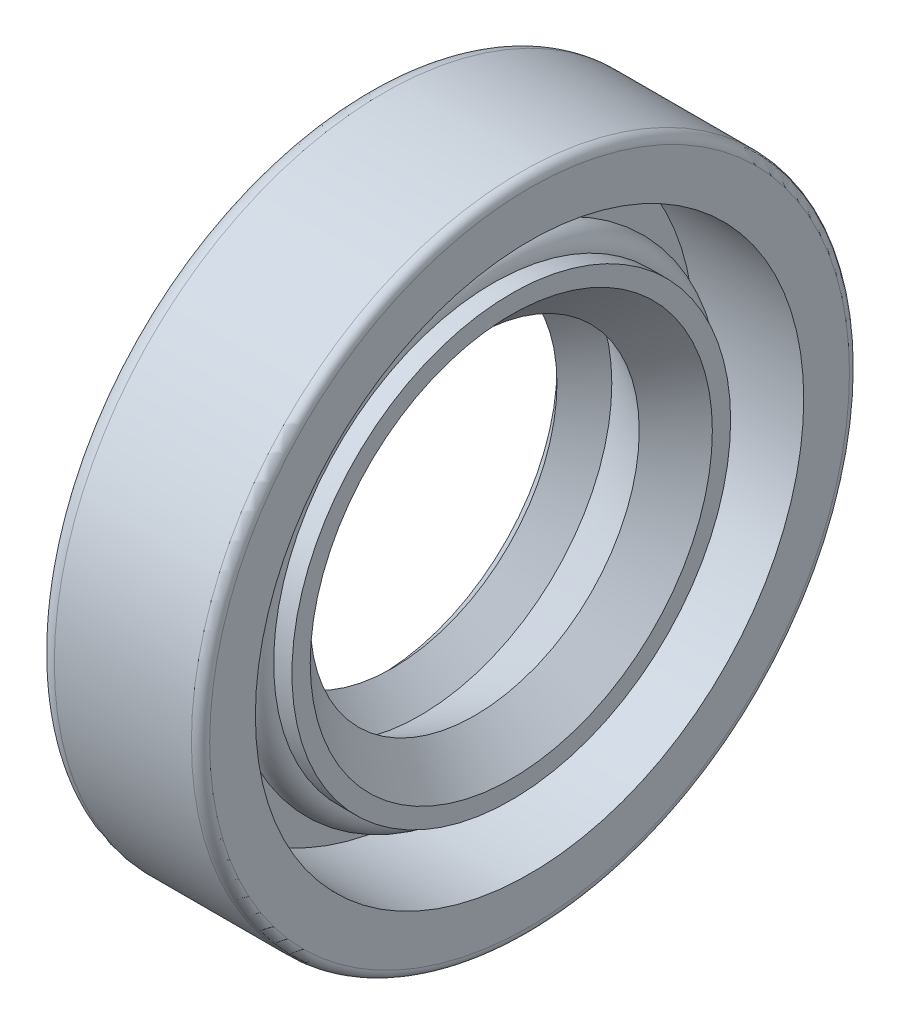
ISO-10303-21;
HEADER;
FILE_DESCRIPTION(('STEP AP214'),'2;1');
FILE_NAME('part.step','',(''),(''),'','','');
FILE_SCHEMA(('AUTOMOTIVE_DESIGN { 1 0 10303 214 1 1 1 1 }'));
ENDSEC;
DATA;
#1=APPLICATION_CONTEXT('core data for automotive mechanical design processes');
#2=APPLICATION_PROTOCOL_DEFINITION('international standard','automotive_design',2000,#1);
#3=PRODUCT_CONTEXT('',#1,'mechanical');
#4=PRODUCT('Part','Part','',(#3));
#5=PRODUCT_RELATED_PRODUCT_CATEGORY('part','',(#4));
#6=PRODUCT_DEFINITION_FORMATION('','',#4);
#7=PRODUCT_DEFINITION_CONTEXT('part definition',#1,'design');
#8=PRODUCT_DEFINITION('design','',#6,#7);
#9=PRODUCT_DEFINITION_SHAPE('','',#8);
#10=(LENGTH_UNIT() NAMED_UNIT(*) SI_UNIT(.MILLI.,.METRE.));
#11=(NAMED_UNIT(*) PLANE_ANGLE_UNIT() SI_UNIT($,.RADIAN.));
#12=(NAMED_UNIT(*) SI_UNIT($,.STERADIAN.) SOLID_ANGLE_UNIT());
#13=UNCERTAINTY_MEASURE_WITH_UNIT(LENGTH_MEASURE(1.E-05),#10,'distance_accuracy_value','');
#14=(GEOMETRIC_REPRESENTATION_CONTEXT(3) GLOBAL_UNCERTAINTY_ASSIGNED_CONTEXT((#13)) GLOBAL_UNIT_ASSIGNED_CONTEXT((#10,
#11,#12)) REPRESENTATION_CONTEXT('',''));
#15=CARTESIAN_POINT('',(0.,0.,0.));
#16=DIRECTION('',(0.,0.,1.));
#17=DIRECTION('',(1.,0.,0.));
#18=AXIS2_PLACEMENT_3D('',#15,#16,#17);
#19=CARTESIAN_POINT('',(1.11111111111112,0.,0.));
#20=DIRECTION('',(1.,0.,0.));
#21=DIRECTION('',(0.,0.,-1.));
#22=AXIS2_PLACEMENT_3D('',#19,#20,#21);
#23=TOROIDAL_SURFACE('',#22,18.8888888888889,1.11111111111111);
#24=CARTESIAN_POINT('',(0.,0.,0.));
#25=DIRECTION('',(1.,0.,0.));
#26=DIRECTION('',(0.,0.,-1.));
#27=AXIS2_PLACEMENT_3D('',#24,#25,#26);
#28=CIRCLE('',#27,18.8888888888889);
#29=CARTESIAN_POINT('',(0.,0.,-18.8888888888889));
#30=VERTEX_POINT('',#29);
#31=EDGE_CURVE('E10',#30,#30,#28,.T.);
#32=ORIENTED_EDGE('',*,*,#31,.T.);
#33=EDGE_LOOP('',(#32));
#34=FACE_BOUND('',#33,.T.);
#35=CARTESIAN_POINT('',(1.11111111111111,0.,0.));
#36=DIRECTION('',(1.,0.,0.));
#37=DIRECTION('',(0.,0.,-1.));
#38=AXIS2_PLACEMENT_3D('',#35,#36,#37);
#39=CIRCLE('',#38,20.);
#40=CARTESIAN_POINT('',(1.11111111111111,0.,-20.));
#41=VERTEX_POINT('',#40);
#42=EDGE_CURVE('E134',#41,#41,#39,.T.);
#43=ORIENTED_EDGE('',*,*,#42,.F.);
#44=EDGE_LOOP('',(#43));
#45=FACE_BOUND('',#44,.T.);
#46=ADVANCED_FACE('F43',(#34,#45),#23,.T.);
#47=CARTESIAN_POINT('',(0.,18.8888888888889,0.));
#48=DIRECTION('',(-1.,0.,0.));
#49=DIRECTION('',(0.,0.,1.));
#50=AXIS2_PLACEMENT_3D('',#47,#48,#49);
#51=PLANE('',#50);
#52=CARTESIAN_POINT('',(0.,0.,0.));
#53=DIRECTION('',(1.,0.,0.));
#54=DIRECTION('',(0.,0.,-1.));
#55=AXIS2_PLACEMENT_3D('',#52,#53,#54);
#56=CIRCLE('',#55,16.6666666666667);
#57=CARTESIAN_POINT('',(0.,0.,-16.6666666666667));
#58=VERTEX_POINT('',#57);
#59=EDGE_CURVE('E50',#58,#58,#56,.T.);
#60=ORIENTED_EDGE('',*,*,#59,.T.);
#61=EDGE_LOOP('',(#60));
#62=FACE_BOUND('',#61,.T.);
#63=ORIENTED_EDGE('',*,*,#31,.F.);
#64=EDGE_LOOP('',(#63));
#65=FACE_BOUND('',#64,.T.);
#66=ADVANCED_FACE('F143',(#62,#65),#51,.T.);
#67=CARTESIAN_POINT('',(0.,0.,0.));
#68=DIRECTION('',(1.,0.,0.));
#69=DIRECTION('',(0.,0.,-1.));
#70=AXIS2_PLACEMENT_3D('',#67,#68,#69);
#71=CYLINDRICAL_SURFACE('',#70,16.6666666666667);
#72=CARTESIAN_POINT('',(0.200000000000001,0.,0.));
#73=DIRECTION('',(1.,0.,0.));
#74=DIRECTION('',(0.,0.,-1.));
#75=AXIS2_PLACEMENT_3D('',#72,#73,#74);
#76=CIRCLE('',#75,16.6666666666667);
#77=CARTESIAN_POINT('',(0.200000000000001,0.,-16.6666666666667));
#78=VERTEX_POINT('',#77);
#79=EDGE_CURVE('E55',#78,#78,#76,.T.);
#80=ORIENTED_EDGE('',*,*,#79,.T.);
#81=EDGE_LOOP('',(#80));
#82=FACE_BOUND('',#81,.T.);
#83=ORIENTED_EDGE('',*,*,#59,.F.);
#84=EDGE_LOOP('',(#83));
#85=FACE_BOUND('',#84,.T.);
#86=ADVANCED_FACE('F147',(#82,#85),#71,.F.);
#87=CARTESIAN_POINT('',(0.2,16.6666666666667,0.));
#88=DIRECTION('',(-1.,0.,0.));
#89=DIRECTION('',(0.,0.,1.));
#90=AXIS2_PLACEMENT_3D('',#87,#88,#89);
#91=PLANE('',#90);
#92=CARTESIAN_POINT('',(0.2,0.,0.));
#93=DIRECTION('',(1.,0.,0.));
#94=DIRECTION('',(0.,0.,-1.));
#95=AXIS2_PLACEMENT_3D('',#92,#93,#94);
#96=CIRCLE('',#95,13.3333333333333);
#97=CARTESIAN_POINT('',(0.2,0.,-13.3333333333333));
#98=VERTEX_POINT('',#97);
#99=EDGE_CURVE('E60',#98,#98,#96,.T.);
#100=ORIENTED_EDGE('',*,*,#99,.T.);
#101=EDGE_LOOP('',(#100));
#102=FACE_BOUND('',#101,.T.);
#103=ORIENTED_EDGE('',*,*,#79,.F.);
#104=EDGE_LOOP('',(#103));
#105=FACE_BOUND('',#104,.T.);
#106=ADVANCED_FACE('F151',(#102,#105),#91,.T.);
#107=CARTESIAN_POINT('',(0.,0.,0.));
#108=DIRECTION('',(1.,0.,0.));
#109=DIRECTION('',(0.,0.,-1.));
#110=AXIS2_PLACEMENT_3D('',#107,#108,#109);
#111=CYLINDRICAL_SURFACE('',#110,13.3333333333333);
#112=CARTESIAN_POINT('',(0.,0.,0.));
#113=DIRECTION('',(1.,0.,0.));
#114=DIRECTION('',(0.,0.,-1.));
#115=AXIS2_PLACEMENT_3D('',#112,#113,#114);
#116=CIRCLE('',#115,13.3333333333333);
#117=CARTESIAN_POINT('',(0.,0.,-13.3333333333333));
#118=VERTEX_POINT('',#117);
#119=EDGE_CURVE('E66',#118,#118,#116,.T.);
#120=ORIENTED_EDGE('',*,*,#119,.T.);
#121=EDGE_LOOP('',(#120));
#122=FACE_BOUND('',#121,.T.);
#123=ORIENTED_EDGE('',*,*,#99,.F.);
#124=EDGE_LOOP('',(#123));
#125=FACE_BOUND('',#124,.T.);
#126=ADVANCED_FACE('F158',(#122,#125),#111,.T.);
#127=CARTESIAN_POINT('',(0.,13.3333333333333,0.));
#128=DIRECTION('',(-1.,0.,0.));
#129=DIRECTION('',(0.,0.,1.));
#130=AXIS2_PLACEMENT_3D('',#127,#128,#129);
#131=PLANE('',#130);
#132=CARTESIAN_POINT('',(0.,0.,0.));
#133=DIRECTION('',(1.,0.,0.));
#134=DIRECTION('',(0.,0.,-1.));
#135=AXIS2_PLACEMENT_3D('',#132,#133,#134);
#136=CIRCLE('',#135,12.5);
#137=CARTESIAN_POINT('',(0.,0.,-12.5));
#138=VERTEX_POINT('',#137);
#139=EDGE_CURVE('E70',#138,#138,#136,.T.);
#140=ORIENTED_EDGE('',*,*,#139,.T.);
#141=EDGE_LOOP('',(#140));
#142=FACE_BOUND('',#141,.T.);
#143=ORIENTED_EDGE('',*,*,#119,.F.);
#144=EDGE_LOOP('',(#143));
#145=FACE_BOUND('',#144,.T.);
#146=ADVANCED_FACE('F162',(#142,#145),#131,.T.);
#147=CARTESIAN_POINT('',(0.,0.,0.));
#148=DIRECTION('',(-1.,0.,0.));
#149=DIRECTION('',(0.,0.,1.));
#150=AXIS2_PLACEMENT_3D('',#147,#148,#149);
#151=CONICAL_SURFACE('',#150,12.5,0.463647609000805);
#152=CARTESIAN_POINT('',(1.66666666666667,0.,0.));
#153=DIRECTION('',(1.,0.,0.));
#154=DIRECTION('',(0.,0.,-1.));
#155=AXIS2_PLACEMENT_3D('',#152,#153,#154);
#156=CIRCLE('',#155,11.6666666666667);
#157=CARTESIAN_POINT('',(1.66666666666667,0.,-11.6666666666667));
#158=VERTEX_POINT('',#157);
#159=EDGE_CURVE('E74',#158,#158,#156,.T.);
#160=ORIENTED_EDGE('',*,*,#159,.T.);
#161=EDGE_LOOP('',(#160));
#162=FACE_BOUND('',#161,.T.);
#163=ORIENTED_EDGE('',*,*,#139,.F.);
#164=EDGE_LOOP('',(#163));
#165=FACE_BOUND('',#164,.T.);
#166=ADVANCED_FACE('F166',(#162,#165),#151,.F.);
#167=CARTESIAN_POINT('',(1.66666666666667,0.,0.));
#168=DIRECTION('',(1.,0.,0.));
#169=DIRECTION('',(0.,0.,-1.));
#170=AXIS2_PLACEMENT_3D('',#167,#168,#169);
#171=CONICAL_SURFACE('',#170,11.6666666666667,0.785398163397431);
#172=CARTESIAN_POINT('',(0.833333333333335,0.,0.));
#173=DIRECTION('',(1.,0.,0.));
#174=DIRECTION('',(0.,0.,-1.));
#175=AXIS2_PLACEMENT_3D('',#172,#173,#174);
#176=CIRCLE('',#175,10.8333333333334);
#177=CARTESIAN_POINT('',(0.833333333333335,0.,-10.8333333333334));
#178=VERTEX_POINT('',#177);
#179=EDGE_CURVE('E78',#178,#178,#176,.T.);
#180=ORIENTED_EDGE('',*,*,#179,.T.);
#181=EDGE_LOOP('',(#180));
#182=FACE_BOUND('',#181,.T.);
#183=ORIENTED_EDGE('',*,*,#159,.F.);
#184=EDGE_LOOP('',(#183));
#185=FACE_BOUND('',#184,.T.);
#186=ADVANCED_FACE('F170',(#182,#185),#171,.T.);
#187=CARTESIAN_POINT('',(0.833333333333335,0.,0.));
#188=DIRECTION('',(-1.,0.,0.));
#189=DIRECTION('',(0.,0.,1.));
#190=AXIS2_PLACEMENT_3D('',#187,#188,#189);
#191=CONICAL_SURFACE('',#190,10.8333333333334,0.785398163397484);
#192=CARTESIAN_POINT('',(1.66666666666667,0.,0.));
#193=DIRECTION('',(1.,0.,0.));
#194=DIRECTION('',(0.,0.,-1.));
#195=AXIS2_PLACEMENT_3D('',#192,#193,#194);
#196=CIRCLE('',#195,9.99999999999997);
#197=CARTESIAN_POINT('',(1.66666666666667,0.,-9.99999999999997));
#198=VERTEX_POINT('',#197);
#199=EDGE_CURVE('E82',#198,#198,#196,.T.);
#200=ORIENTED_EDGE('',*,*,#199,.T.);
#201=EDGE_LOOP('',(#200));
#202=FACE_BOUND('',#201,.T.);
#203=ORIENTED_EDGE('',*,*,#179,.F.);
#204=EDGE_LOOP('',(#203));
#205=FACE_BOUND('',#204,.T.);
#206=ADVANCED_FACE('F174',(#202,#205),#191,.F.);
#207=CARTESIAN_POINT('',(1.66666666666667,0.,0.));
#208=DIRECTION('',(1.,0.,0.));
#209=DIRECTION('',(0.,0.,-1.));
#210=AXIS2_PLACEMENT_3D('',#207,#208,#209);
#211=CONICAL_SURFACE('',#210,9.99999999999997,0.785398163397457);
#212=CARTESIAN_POINT('',(3.33333333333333,0.,0.));
#213=DIRECTION('',(1.,0.,0.));
#214=DIRECTION('',(0.,0.,-1.));
#215=AXIS2_PLACEMENT_3D('',#212,#213,#214);
#216=CIRCLE('',#215,11.6666666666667);
#217=CARTESIAN_POINT('',(3.33333333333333,0.,-11.6666666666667));
#218=VERTEX_POINT('',#217);
#219=EDGE_CURVE('E86',#218,#218,#216,.T.);
#220=ORIENTED_EDGE('',*,*,#219,.T.);
#221=EDGE_LOOP('',(#220));
#222=FACE_BOUND('',#221,.T.);
#223=ORIENTED_EDGE('',*,*,#199,.F.);
#224=EDGE_LOOP('',(#223));
#225=FACE_BOUND('',#224,.T.);
#226=ADVANCED_FACE('F178',(#222,#225),#211,.F.);
#227=CARTESIAN_POINT('',(3.33333333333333,0.,0.));
#228=DIRECTION('',(-1.,0.,0.));
#229=DIRECTION('',(0.,0.,1.));
#230=AXIS2_PLACEMENT_3D('',#227,#228,#229);
#231=CONICAL_SURFACE('',#230,11.6666666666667,0.463647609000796);
#232=CARTESIAN_POINT('',(6.66666666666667,0.,0.));
#233=DIRECTION('',(1.,0.,0.));
#234=DIRECTION('',(0.,0.,-1.));
#235=AXIS2_PLACEMENT_3D('',#232,#233,#234);
#236=CIRCLE('',#235,10.);
#237=CARTESIAN_POINT('',(6.66666666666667,0.,-10.));
#238=VERTEX_POINT('',#237);
#239=EDGE_CURVE('E90',#238,#238,#236,.T.);
#240=ORIENTED_EDGE('',*,*,#239,.T.);
#241=EDGE_LOOP('',(#240));
#242=FACE_BOUND('',#241,.T.);
#243=ORIENTED_EDGE('',*,*,#219,.F.);
#244=EDGE_LOOP('',(#243));
#245=FACE_BOUND('',#244,.T.);
#246=ADVANCED_FACE('F182',(#242,#245),#231,.F.);
#247=CARTESIAN_POINT('',(6.66666666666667,0.,0.));
#248=DIRECTION('',(1.,0.,0.));
#249=DIRECTION('',(0.,0.,-1.));
#250=AXIS2_PLACEMENT_3D('',#247,#248,#249);
#251=CONICAL_SURFACE('',#250,10.,0.785398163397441);
#252=CARTESIAN_POINT('',(8.88888883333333,0.,0.));
#253=DIRECTION('',(1.,0.,0.));
#254=DIRECTION('',(0.,0.,-1.));
#255=AXIS2_PLACEMENT_3D('',#252,#253,#254);
#256=CIRCLE('',#255,12.2222221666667);
#257=CARTESIAN_POINT('',(8.88888883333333,0.,-12.2222221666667));
#258=VERTEX_POINT('',#257);
#259=EDGE_CURVE('E94',#258,#258,#256,.T.);
#260=ORIENTED_EDGE('',*,*,#259,.T.);
#261=EDGE_LOOP('',(#260));
#262=FACE_BOUND('',#261,.T.);
#263=ORIENTED_EDGE('',*,*,#239,.F.);
#264=EDGE_LOOP('',(#263));
#265=FACE_BOUND('',#264,.T.);
#266=ADVANCED_FACE('F186',(#262,#265),#251,.F.);
#267=CARTESIAN_POINT('',(8.88888883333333,12.2222221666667,0.));
#268=DIRECTION('',(1.,0.,0.));
#269=DIRECTION('',(0.,0.,-1.));
#270=AXIS2_PLACEMENT_3D('',#267,#268,#269);
#271=PLANE('',#270);
#272=CARTESIAN_POINT('',(8.88888883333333,0.,0.));
#273=DIRECTION('',(1.,0.,0.));
#274=DIRECTION('',(0.,0.,-1.));
#275=AXIS2_PLACEMENT_3D('',#272,#273,#274);
#276=CIRCLE('',#275,13.3333333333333);
#277=CARTESIAN_POINT('',(8.88888883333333,0.,-13.3333333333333));
#278=VERTEX_POINT('',#277);
#279=EDGE_CURVE('E98',#278,#278,#276,.T.);
#280=ORIENTED_EDGE('',*,*,#279,.T.);
#281=EDGE_LOOP('',(#280));
#282=FACE_BOUND('',#281,.T.);
#283=ORIENTED_EDGE('',*,*,#259,.F.);
#284=EDGE_LOOP('',(#283));
#285=FACE_BOUND('',#284,.T.);
#286=ADVANCED_FACE('F190',(#282,#285),#271,.T.);
#287=CARTESIAN_POINT('',(0.,0.,0.));
#288=DIRECTION('',(1.,0.,0.));
#289=DIRECTION('',(0.,0.,-1.));
#290=AXIS2_PLACEMENT_3D('',#287,#288,#289);
#291=CYLINDRICAL_SURFACE('',#290,13.3333333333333);
#292=CARTESIAN_POINT('',(7.77777766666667,0.,0.));
#293=DIRECTION('',(1.,0.,0.));
#294=DIRECTION('',(0.,0.,-1.));
#295=AXIS2_PLACEMENT_3D('',#292,#293,#294);
#296=CIRCLE('',#295,13.3333333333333);
#297=CARTESIAN_POINT('',(7.77777766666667,0.,-13.3333333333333));
#298=VERTEX_POINT('',#297);
#299=EDGE_CURVE('E102',#298,#298,#296,.T.);
#300=ORIENTED_EDGE('',*,*,#299,.T.);
#301=EDGE_LOOP('',(#300));
#302=FACE_BOUND('',#301,.T.);
#303=ORIENTED_EDGE('',*,*,#279,.F.);
#304=EDGE_LOOP('',(#303));
#305=FACE_BOUND('',#304,.T.);
#306=ADVANCED_FACE('F194',(#302,#305),#291,.T.);
#307=CARTESIAN_POINT('',(6.66666666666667,0.,0.));
#308=DIRECTION('',(1.,0.,0.));
#309=DIRECTION('',(0.,0.,-1.));
#310=AXIS2_PLACEMENT_3D('',#307,#308,#309);
#311=TOROIDAL_SURFACE('',#310,13.3333333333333,1.111111);
#312=CARTESIAN_POINT('',(5.55555566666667,0.,0.));
#313=DIRECTION('',(1.,0.,0.));
#314=DIRECTION('',(0.,0.,-1.));
#315=AXIS2_PLACEMENT_3D('',#312,#313,#314);
#316=CIRCLE('',#315,13.3333333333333);
#317=CARTESIAN_POINT('',(5.55555566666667,0.,-13.3333333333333));
#318=VERTEX_POINT('',#317);
#319=EDGE_CURVE('E106',#318,#318,#316,.T.);
#320=ORIENTED_EDGE('',*,*,#319,.T.);
#321=EDGE_LOOP('',(#320));
#322=FACE_BOUND('',#321,.T.);
#323=ORIENTED_EDGE('',*,*,#299,.F.);
#324=EDGE_LOOP('',(#323));
#325=FACE_BOUND('',#324,.T.);
#326=ADVANCED_FACE('F198',(#322,#325),#311,.T.);
#327=CARTESIAN_POINT('',(0.,0.,0.));
#328=DIRECTION('',(1.,0.,0.));
#329=DIRECTION('',(0.,0.,-1.));
#330=AXIS2_PLACEMENT_3D('',#327,#328,#329);
#331=CYLINDRICAL_SURFACE('',#330,13.3333333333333);
#332=CARTESIAN_POINT('',(3.88888883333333,0.,0.));
#333=DIRECTION('',(1.,0.,0.));
#334=DIRECTION('',(0.,0.,-1.));
#335=AXIS2_PLACEMENT_3D('',#332,#333,#334);
#336=CIRCLE('',#335,13.3333333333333);
#337=CARTESIAN_POINT('',(3.88888883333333,0.,-13.3333333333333));
#338=VERTEX_POINT('',#337);
#339=EDGE_CURVE('E110',#338,#338,#336,.T.);
#340=ORIENTED_EDGE('',*,*,#339,.T.);
#341=EDGE_LOOP('',(#340));
#342=FACE_BOUND('',#341,.T.);
#343=ORIENTED_EDGE('',*,*,#319,.F.);
#344=EDGE_LOOP('',(#343));
#345=FACE_BOUND('',#344,.T.);
#346=ADVANCED_FACE('F202',(#342,#345),#331,.T.);
#347=CARTESIAN_POINT('',(3.88888883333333,0.,0.));
#348=DIRECTION('',(1.,0.,0.));
#349=DIRECTION('',(0.,0.,-1.));
#350=AXIS2_PLACEMENT_3D('',#347,#348,#349);
#351=TOROIDAL_SURFACE('',#350,13.8888888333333,0.555555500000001);
#352=CARTESIAN_POINT('',(3.33333333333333,0.,0.));
#353=DIRECTION('',(1.,0.,0.));
#354=DIRECTION('',(0.,0.,-1.));
#355=AXIS2_PLACEMENT_3D('',#352,#353,#354);
#356=CIRCLE('',#355,13.8888888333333);
#357=CARTESIAN_POINT('',(3.33333333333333,0.,-13.8888888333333));
#358=VERTEX_POINT('',#357);
#359=EDGE_CURVE('E114',#358,#358,#356,.T.);
#360=ORIENTED_EDGE('',*,*,#359,.T.);
#361=EDGE_LOOP('',(#360));
#362=FACE_BOUND('',#361,.T.);
#363=ORIENTED_EDGE('',*,*,#339,.F.);
#364=EDGE_LOOP('',(#363));
#365=FACE_BOUND('',#364,.T.);
#366=ADVANCED_FACE('F206',(#362,#365),#351,.F.);
#367=CARTESIAN_POINT('',(3.33333333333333,13.8888888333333,0.));
#368=DIRECTION('',(1.,0.,0.));
#369=DIRECTION('',(0.,0.,-1.));
#370=AXIS2_PLACEMENT_3D('',#367,#368,#369);
#371=PLANE('',#370);
#372=CARTESIAN_POINT('',(3.33333333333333,0.,0.));
#373=DIRECTION('',(1.,0.,0.));
#374=DIRECTION('',(0.,0.,-1.));
#375=AXIS2_PLACEMENT_3D('',#372,#373,#374);
#376=CIRCLE('',#375,16.6666666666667);
#377=CARTESIAN_POINT('',(3.33333333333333,0.,-16.6666666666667));
#378=VERTEX_POINT('',#377);
#379=EDGE_CURVE('E118',#378,#378,#376,.T.);
#380=ORIENTED_EDGE('',*,*,#379,.T.);
#381=EDGE_LOOP('',(#380));
#382=FACE_BOUND('',#381,.T.);
#383=ORIENTED_EDGE('',*,*,#359,.F.);
#384=EDGE_LOOP('',(#383));
#385=FACE_BOUND('',#384,.T.);
#386=ADVANCED_FACE('F210',(#382,#385),#371,.T.);
#387=CARTESIAN_POINT('',(0.,0.,0.));
#388=DIRECTION('',(1.,0.,0.));
#389=DIRECTION('',(0.,0.,-1.));
#390=AXIS2_PLACEMENT_3D('',#387,#388,#389);
#391=CYLINDRICAL_SURFACE('',#390,16.6666666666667);
#392=CARTESIAN_POINT('',(10.,0.,0.));
#393=DIRECTION('',(1.,0.,0.));
#394=DIRECTION('',(0.,0.,-1.));
#395=AXIS2_PLACEMENT_3D('',#392,#393,#394);
#396=CIRCLE('',#395,16.6666666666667);
#397=CARTESIAN_POINT('',(10.,0.,-16.6666666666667));
#398=VERTEX_POINT('',#397);
#399=EDGE_CURVE('E122',#398,#398,#396,.T.);
#400=ORIENTED_EDGE('',*,*,#399,.T.);
#401=EDGE_LOOP('',(#400));
#402=FACE_BOUND('',#401,.T.);
#403=ORIENTED_EDGE('',*,*,#379,.F.);
#404=EDGE_LOOP('',(#403));
#405=FACE_BOUND('',#404,.T.);
#406=ADVANCED_FACE('F214',(#402,#405),#391,.F.);
#407=CARTESIAN_POINT('',(10.,16.6666666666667,0.));
#408=DIRECTION('',(1.,0.,0.));
#409=DIRECTION('',(0.,0.,-1.));
#410=AXIS2_PLACEMENT_3D('',#407,#408,#409);
#411=PLANE('',#410);
#412=CARTESIAN_POINT('',(10.,0.,0.));
#413=DIRECTION('',(1.,0.,0.));
#414=DIRECTION('',(0.,0.,-1.));
#415=AXIS2_PLACEMENT_3D('',#412,#413,#414);
#416=CIRCLE('',#415,19.4444444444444);
#417=CARTESIAN_POINT('',(10.,0.,-19.4444444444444));
#418=VERTEX_POINT('',#417);
#419=EDGE_CURVE('E126',#418,#418,#416,.T.);
#420=ORIENTED_EDGE('',*,*,#419,.T.);
#421=EDGE_LOOP('',(#420));
#422=FACE_BOUND('',#421,.T.);
#423=ORIENTED_EDGE('',*,*,#399,.F.);
#424=EDGE_LOOP('',(#423));
#425=FACE_BOUND('',#424,.T.);
#426=ADVANCED_FACE('F218',(#422,#425),#411,.T.);
#427=CARTESIAN_POINT('',(9.44444444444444,0.,0.));
#428=DIRECTION('',(1.,0.,0.));
#429=DIRECTION('',(0.,0.,-1.));
#430=AXIS2_PLACEMENT_3D('',#427,#428,#429);
#431=TOROIDAL_SURFACE('',#430,19.4444444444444,0.555555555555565);
#432=CARTESIAN_POINT('',(9.44444444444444,0.,0.));
#433=DIRECTION('',(1.,0.,0.));
#434=DIRECTION('',(0.,0.,-1.));
#435=AXIS2_PLACEMENT_3D('',#432,#433,#434);
#436=CIRCLE('',#435,20.);
#437=CARTESIAN_POINT('',(9.44444444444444,0.,-20.));
#438=VERTEX_POINT('',#437);
#439=EDGE_CURVE('E130',#438,#438,#436,.T.);
#440=ORIENTED_EDGE('',*,*,#439,.T.);
#441=EDGE_LOOP('',(#440));
#442=FACE_BOUND('',#441,.T.);
#443=ORIENTED_EDGE('',*,*,#419,.F.);
#444=EDGE_LOOP('',(#443));
#445=FACE_BOUND('',#444,.T.);
#446=ADVANCED_FACE('F222',(#442,#445),#431,.T.);
#447=CARTESIAN_POINT('',(0.,0.,0.));
#448=DIRECTION('',(1.,0.,0.));
#449=DIRECTION('',(0.,0.,-1.));
#450=AXIS2_PLACEMENT_3D('',#447,#448,#449);
#451=CYLINDRICAL_SURFACE('',#450,20.);
#452=ORIENTED_EDGE('',*,*,#42,.T.);
#453=EDGE_LOOP('',(#452));
#454=FACE_BOUND('',#453,.T.);
#455=ORIENTED_EDGE('',*,*,#439,.F.);
#456=EDGE_LOOP('',(#455));
#457=FACE_BOUND('',#456,.T.);
#458=ADVANCED_FACE('F139',(#454,#457),#451,.T.);
#459=CLOSED_SHELL('',(#46,#66,#86,#106,#126,#146,#166,#186,#206,#226,#246,#266,#286,#306,#326,
#346,#366,#386,#406,#426,#446,#458));
#460=MANIFOLD_SOLID_BREP('B2',#459);
#461=ADVANCED_BREP_SHAPE_REPRESENTATION('',(#18,#460),#14);
#462=SHAPE_DEFINITION_REPRESENTATION(#9,#461);
ENDSEC;
END-ISO-10303-21;
